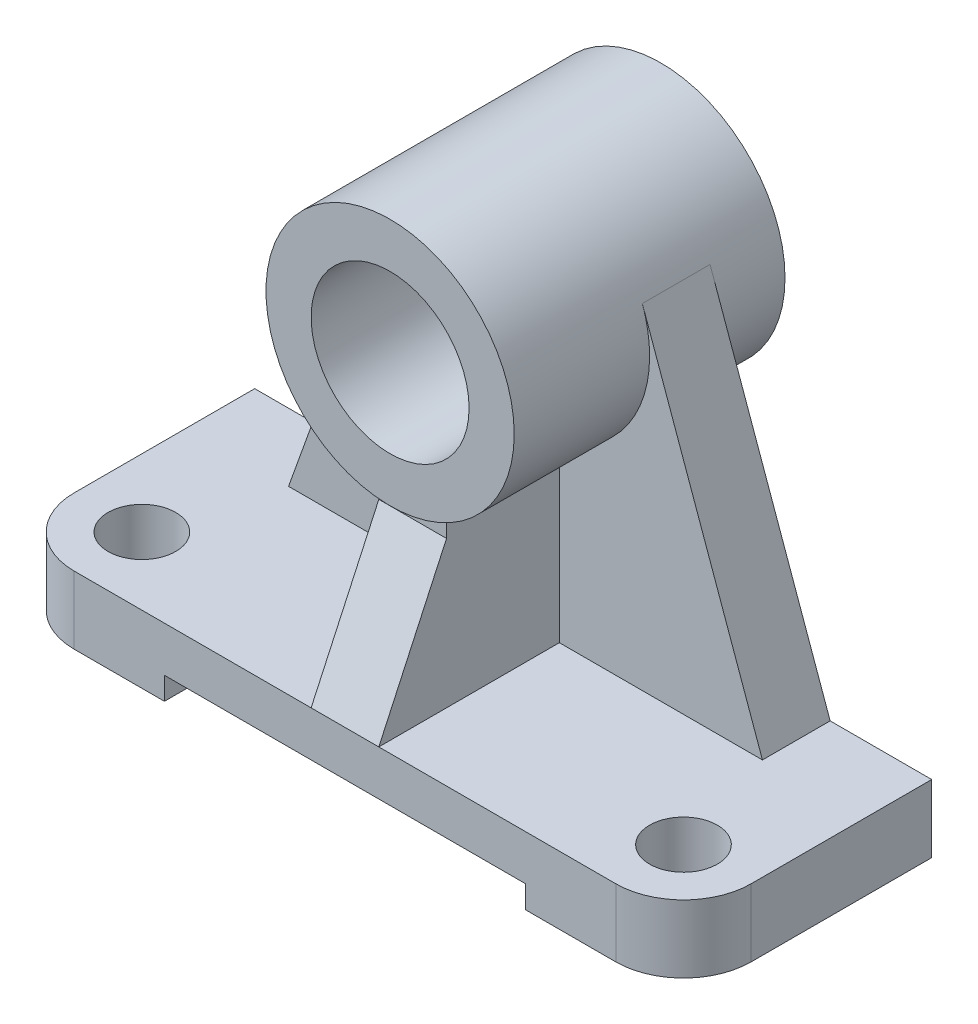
ISO-10303-21;
HEADER;
FILE_DESCRIPTION(('STEP AP214'),'2;1');
FILE_NAME('part.step','',(''),(''),'','','');
FILE_SCHEMA(('AUTOMOTIVE_DESIGN { 1 0 10303 214 1 1 1 1 }'));
ENDSEC;
DATA;
#1=APPLICATION_CONTEXT('core data for automotive mechanical design processes');
#2=APPLICATION_PROTOCOL_DEFINITION('international standard','automotive_design',2000,#1);
#3=PRODUCT_CONTEXT('',#1,'mechanical');
#4=PRODUCT('Part','Part','',(#3));
#5=PRODUCT_RELATED_PRODUCT_CATEGORY('part','',(#4));
#6=PRODUCT_DEFINITION_FORMATION('','',#4);
#7=PRODUCT_DEFINITION_CONTEXT('part definition',#1,'design');
#8=PRODUCT_DEFINITION('design','',#6,#7);
#9=PRODUCT_DEFINITION_SHAPE('','',#8);
#10=(LENGTH_UNIT() NAMED_UNIT(*) SI_UNIT(.MILLI.,.METRE.));
#11=(NAMED_UNIT(*) PLANE_ANGLE_UNIT() SI_UNIT($,.RADIAN.));
#12=(NAMED_UNIT(*) SI_UNIT($,.STERADIAN.) SOLID_ANGLE_UNIT());
#13=UNCERTAINTY_MEASURE_WITH_UNIT(LENGTH_MEASURE(1.E-05),#10,'distance_accuracy_value','');
#14=(GEOMETRIC_REPRESENTATION_CONTEXT(3) GLOBAL_UNCERTAINTY_ASSIGNED_CONTEXT((#13)) GLOBAL_UNIT_ASSIGNED_CONTEXT((#10,
#11,#12)) REPRESENTATION_CONTEXT('',''));
#15=CARTESIAN_POINT('',(0.,0.,0.));
#16=DIRECTION('',(0.,0.,1.));
#17=DIRECTION('',(1.,0.,0.));
#18=AXIS2_PLACEMENT_3D('',#15,#16,#17);
#19=CARTESIAN_POINT('',(-24.,6.,16.));
#20=DIRECTION('',(0.,1.,0.));
#21=DIRECTION('',(0.,0.,1.));
#22=AXIS2_PLACEMENT_3D('',#19,#20,#21);
#23=PLANE('',#22);
#24=CARTESIAN_POINT('',(24.,6.,16.));
#25=DIRECTION('',(0.,1.,0.));
#26=DIRECTION('',(0.,0.,-1.));
#27=AXIS2_PLACEMENT_3D('',#24,#25,#26);
#28=CIRCLE('',#27,3.);
#29=CARTESIAN_POINT('',(24.,6.,13.));
#30=VERTEX_POINT('',#29);
#31=EDGE_CURVE('E304',#30,#30,#28,.T.);
#32=ORIENTED_EDGE('',*,*,#31,.F.);
#33=EDGE_LOOP('',(#32));
#34=FACE_BOUND('',#33,.T.);
#35=DIRECTION('',(1.,0.,0.));
#36=VECTOR('',#35,1.);
#37=CARTESIAN_POINT('',(-21.,6.,6.));
#38=LINE('',#37,#36);
#39=CARTESIAN_POINT('',(3.,6.,6.));
#40=VERTEX_POINT('',#39);
#41=CARTESIAN_POINT('',(21.,6.,6.));
#42=VERTEX_POINT('',#41);
#43=EDGE_CURVE('E205',#40,#42,#38,.T.);
#44=ORIENTED_EDGE('',*,*,#43,.F.);
#45=DIRECTION('',(0.,0.,-1.));
#46=VECTOR('',#45,1.);
#47=CARTESIAN_POINT('',(3.,6.,6.));
#48=LINE('',#47,#46);
#49=CARTESIAN_POINT('',(3.,6.,22.));
#50=VERTEX_POINT('',#49);
#51=EDGE_CURVE('E180',#50,#40,#48,.T.);
#52=ORIENTED_EDGE('',*,*,#51,.F.);
#53=DIRECTION('',(1.,0.,0.));
#54=VECTOR('',#53,1.);
#55=CARTESIAN_POINT('',(-24.,6.,22.));
#56=LINE('',#55,#54);
#57=CARTESIAN_POINT('',(24.,6.,22.));
#58=VERTEX_POINT('',#57);
#59=EDGE_CURVE('E322',#50,#58,#56,.T.);
#60=ORIENTED_EDGE('',*,*,#59,.T.);
#61=CARTESIAN_POINT('',(24.,6.,16.));
#62=DIRECTION('',(0.,1.,0.));
#63=DIRECTION('',(0.,0.,-1.));
#64=AXIS2_PLACEMENT_3D('',#61,#62,#63);
#65=CIRCLE('',#64,6.);
#66=CARTESIAN_POINT('',(30.,6.,16.));
#67=VERTEX_POINT('',#66);
#68=EDGE_CURVE('E326',#58,#67,#65,.T.);
#69=ORIENTED_EDGE('',*,*,#68,.T.);
#70=DIRECTION('',(0.,0.,-1.));
#71=VECTOR('',#70,1.);
#72=CARTESIAN_POINT('',(30.,6.,0.));
#73=LINE('',#72,#71);
#74=CARTESIAN_POINT('',(30.,6.,0.));
#75=VERTEX_POINT('',#74);
#76=EDGE_CURVE('E328',#67,#75,#73,.T.);
#77=ORIENTED_EDGE('',*,*,#76,.T.);
#78=DIRECTION('',(-1.,0.,0.));
#79=VECTOR('',#78,1.);
#80=CARTESIAN_POINT('',(30.,6.,0.));
#81=LINE('',#80,#79);
#82=CARTESIAN_POINT('',(21.,6.,0.));
#83=VERTEX_POINT('',#82);
#84=EDGE_CURVE('E272',#75,#83,#81,.T.);
#85=ORIENTED_EDGE('',*,*,#84,.T.);
#86=DIRECTION('',(0.,0.,-1.));
#87=VECTOR('',#86,1.);
#88=CARTESIAN_POINT('',(21.,6.,6.));
#89=LINE('',#88,#87);
#90=EDGE_CURVE('E234',#42,#83,#89,.T.);
#91=ORIENTED_EDGE('',*,*,#90,.F.);
#92=EDGE_LOOP('',(#44,#52,#60,#69,#77,#85,#91));
#93=FACE_BOUND('',#92,.T.);
#94=ADVANCED_FACE('F31',(#34,#93),#23,.T.);
#95=CARTESIAN_POINT('',(0.,32.,6.));
#96=DIRECTION('',(0.,0.,1.));
#97=DIRECTION('',(1.,0.,0.));
#98=AXIS2_PLACEMENT_3D('',#95,#96,#97);
#99=PLANE('',#98);
#100=CARTESIAN_POINT('',(0.,32.,6.));
#101=DIRECTION('',(0.,0.,-1.));
#102=DIRECTION('',(1.,0.,0.));
#103=AXIS2_PLACEMENT_3D('',#100,#101,#102);
#104=CIRCLE('',#103,11.);
#105=CARTESIAN_POINT('',(10.3554232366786,35.7101495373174,6.));
#106=VERTEX_POINT('',#105);
#107=CARTESIAN_POINT('',(3.,21.4169947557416,6.));
#108=VERTEX_POINT('',#107);
#109=EDGE_CURVE('E209',#106,#108,#104,.T.);
#110=ORIENTED_EDGE('',*,*,#109,.T.);
#111=DIRECTION('',(0.,1.,0.));
#112=VECTOR('',#111,1.);
#113=CARTESIAN_POINT('',(3.,22.8369591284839,6.));
#114=LINE('',#113,#112);
#115=EDGE_CURVE('E188',#40,#108,#114,.T.);
#116=ORIENTED_EDGE('',*,*,#115,.F.);
#117=ORIENTED_EDGE('',*,*,#43,.T.);
#118=DIRECTION('',(-0.337286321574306,0.94140211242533,0.));
#119=VECTOR('',#118,1.);
#120=CARTESIAN_POINT('',(10.3554232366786,35.7101495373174,6.));
#121=LINE('',#120,#119);
#122=EDGE_CURVE('E204',#42,#106,#121,.T.);
#123=ORIENTED_EDGE('',*,*,#122,.T.);
#124=EDGE_LOOP('',(#110,#116,#117,#123));
#125=FACE_BOUND('',#124,.T.);
#126=ADVANCED_FACE('F267',(#125),#99,.T.);
#127=CARTESIAN_POINT('',(0.,32.,18.));
#128=DIRECTION('',(0.,0.,-1.));
#129=DIRECTION('',(-1.,0.,0.));
#130=AXIS2_PLACEMENT_3D('',#127,#128,#129);
#131=CYLINDRICAL_SURFACE('',#130,11.);
#132=CARTESIAN_POINT('',(0.,32.,18.));
#133=DIRECTION('',(0.,0.,1.));
#134=DIRECTION('',(1.,0.,0.));
#135=AXIS2_PLACEMENT_3D('',#132,#133,#134);
#136=CIRCLE('',#135,11.);
#137=CARTESIAN_POINT('',(11.,32.,18.));
#138=VERTEX_POINT('',#137);
#139=EDGE_CURVE('E195',#138,#138,#136,.T.);
#140=ORIENTED_EDGE('',*,*,#139,.F.);
#141=EDGE_LOOP('',(#140));
#142=FACE_BOUND('',#141,.T.);
#143=CARTESIAN_POINT('',(0.,32.,-6.));
#144=DIRECTION('',(0.,0.,1.));
#145=DIRECTION('',(1.,0.,0.));
#146=AXIS2_PLACEMENT_3D('',#143,#144,#145);
#147=CIRCLE('',#146,11.);
#148=CARTESIAN_POINT('',(11.,32.,-6.));
#149=VERTEX_POINT('',#148);
#150=EDGE_CURVE('E193',#149,#149,#147,.T.);
#151=ORIENTED_EDGE('',*,*,#150,.T.);
#152=EDGE_LOOP('',(#151));
#153=FACE_BOUND('',#152,.T.);
#154=DIRECTION('',(0.,0.,-1.));
#155=VECTOR('',#154,1.);
#156=CARTESIAN_POINT('',(3.,21.4169947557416,18.));
#157=LINE('',#156,#155);
#158=CARTESIAN_POINT('',(3.,21.4169947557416,16.));
#159=VERTEX_POINT('',#158);
#160=EDGE_CURVE('E11',#108,#159,#157,.F.);
#161=ORIENTED_EDGE('',*,*,#160,.F.);
#162=ORIENTED_EDGE('',*,*,#109,.F.);
#163=DIRECTION('',(0.,0.,-1.));
#164=VECTOR('',#163,1.);
#165=CARTESIAN_POINT('',(10.3554232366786,35.7101495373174,6.));
#166=LINE('',#165,#164);
#167=CARTESIAN_POINT('',(10.3554232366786,35.7101495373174,0.));
#168=VERTEX_POINT('',#167);
#169=EDGE_CURVE('E238',#106,#168,#166,.T.);
#170=ORIENTED_EDGE('',*,*,#169,.T.);
#171=CARTESIAN_POINT('',(0.,32.,0.));
#172=DIRECTION('',(0.,0.,-1.));
#173=DIRECTION('',(1.,0.,0.));
#174=AXIS2_PLACEMENT_3D('',#171,#172,#173);
#175=CIRCLE('',#174,11.);
#176=CARTESIAN_POINT('',(-10.3554232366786,35.7101495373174,0.));
#177=VERTEX_POINT('',#176);
#178=EDGE_CURVE('E215',#168,#177,#175,.T.);
#179=ORIENTED_EDGE('',*,*,#178,.T.);
#180=DIRECTION('',(0.,0.,-1.));
#181=VECTOR('',#180,1.);
#182=CARTESIAN_POINT('',(-10.3554232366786,35.7101495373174,6.));
#183=LINE('',#182,#181);
#184=CARTESIAN_POINT('',(-10.3554232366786,35.7101495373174,6.));
#185=VERTEX_POINT('',#184);
#186=EDGE_CURVE('E219',#185,#177,#183,.T.);
#187=ORIENTED_EDGE('',*,*,#186,.F.);
#188=CARTESIAN_POINT('',(-3.,21.4169947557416,6.));
#189=VERTEX_POINT('',#188);
#190=EDGE_CURVE('E208',#189,#185,#104,.T.);
#191=ORIENTED_EDGE('',*,*,#190,.F.);
#192=DIRECTION('',(0.,0.,-1.));
#193=VECTOR('',#192,1.);
#194=CARTESIAN_POINT('',(-3.,21.4169947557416,18.));
#195=LINE('',#194,#193);
#196=CARTESIAN_POINT('',(-3.,21.4169947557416,16.));
#197=VERTEX_POINT('',#196);
#198=EDGE_CURVE('E241',#189,#197,#195,.F.);
#199=ORIENTED_EDGE('',*,*,#198,.T.);
#200=CARTESIAN_POINT('',(0.,32.,16.));
#201=DIRECTION('',(0.,0.,-1.));
#202=DIRECTION('',(-1.,0.,0.));
#203=AXIS2_PLACEMENT_3D('',#200,#201,#202);
#204=CIRCLE('',#203,11.);
#205=EDGE_CURVE('E39',#159,#197,#204,.T.);
#206=ORIENTED_EDGE('',*,*,#205,.F.);
#207=EDGE_LOOP('',(#161,#162,#170,#179,#187,#191,#199,#206));
#208=FACE_BOUND('',#207,.T.);
#209=ADVANCED_FACE('F246',(#142,#153,#208),#131,.T.);
#210=CARTESIAN_POINT('',(-24.,0.,16.));
#211=DIRECTION('',(0.,1.,0.));
#212=DIRECTION('',(0.,0.,1.));
#213=AXIS2_PLACEMENT_3D('',#210,#211,#212);
#214=PLANE('',#213);
#215=CARTESIAN_POINT('',(-24.,0.,16.));
#216=DIRECTION('',(0.,1.,0.));
#217=DIRECTION('',(0.,0.,1.));
#218=AXIS2_PLACEMENT_3D('',#215,#216,#217);
#219=CIRCLE('',#218,3.);
#220=CARTESIAN_POINT('',(-24.,0.,19.));
#221=VERTEX_POINT('',#220);
#222=EDGE_CURVE('E307',#221,#221,#219,.T.);
#223=ORIENTED_EDGE('',*,*,#222,.T.);
#224=EDGE_LOOP('',(#223));
#225=FACE_BOUND('',#224,.T.);
#226=DIRECTION('',(-1.,0.,0.));
#227=VECTOR('',#226,1.);
#228=CARTESIAN_POINT('',(30.,0.,0.));
#229=LINE('',#228,#227);
#230=CARTESIAN_POINT('',(-16.,0.,0.));
#231=VERTEX_POINT('',#230);
#232=CARTESIAN_POINT('',(-30.,0.,0.));
#233=VERTEX_POINT('',#232);
#234=EDGE_CURVE('E353',#231,#233,#229,.T.);
#235=ORIENTED_EDGE('',*,*,#234,.F.);
#236=DIRECTION('',(0.,0.,1.));
#237=VECTOR('',#236,1.);
#238=CARTESIAN_POINT('',(-16.,0.,0.));
#239=LINE('',#238,#237);
#240=CARTESIAN_POINT('',(-16.,0.,22.));
#241=VERTEX_POINT('',#240);
#242=EDGE_CURVE('E288',#231,#241,#239,.T.);
#243=ORIENTED_EDGE('',*,*,#242,.T.);
#244=DIRECTION('',(1.,0.,0.));
#245=VECTOR('',#244,1.);
#246=CARTESIAN_POINT('',(-24.,0.,22.));
#247=LINE('',#246,#245);
#248=CARTESIAN_POINT('',(-24.,0.,22.));
#249=VERTEX_POINT('',#248);
#250=EDGE_CURVE('E358',#249,#241,#247,.T.);
#251=ORIENTED_EDGE('',*,*,#250,.F.);
#252=CARTESIAN_POINT('',(-24.,0.,16.));
#253=DIRECTION('',(0.,1.,0.));
#254=DIRECTION('',(0.,0.,1.));
#255=AXIS2_PLACEMENT_3D('',#252,#253,#254);
#256=CIRCLE('',#255,6.);
#257=CARTESIAN_POINT('',(-30.,0.,16.));
#258=VERTEX_POINT('',#257);
#259=EDGE_CURVE('E361',#258,#249,#256,.T.);
#260=ORIENTED_EDGE('',*,*,#259,.F.);
#261=DIRECTION('',(0.,0.,1.));
#262=VECTOR('',#261,1.);
#263=CARTESIAN_POINT('',(-30.,0.,0.));
#264=LINE('',#263,#262);
#265=EDGE_CURVE('E313',#233,#258,#264,.T.);
#266=ORIENTED_EDGE('',*,*,#265,.F.);
#267=EDGE_LOOP('',(#235,#243,#251,#260,#266));
#268=FACE_BOUND('',#267,.T.);
#269=ADVANCED_FACE('F372',(#225,#268),#214,.F.);
#270=DIRECTION('',(0.,0.,-1.));
#271=VECTOR('',#270,1.);
#272=CARTESIAN_POINT('',(-3.,6.,6.));
#273=LINE('',#272,#271);
#274=CARTESIAN_POINT('',(-3.,6.,22.));
#275=VERTEX_POINT('',#274);
#276=CARTESIAN_POINT('',(-3.,6.,6.));
#277=VERTEX_POINT('',#276);
#278=EDGE_CURVE('E255',#275,#277,#273,.T.);
#279=ORIENTED_EDGE('',*,*,#278,.T.);
#280=CARTESIAN_POINT('',(-21.,6.,6.));
#281=VERTEX_POINT('',#280);
#282=EDGE_CURVE('E201',#281,#277,#38,.T.);
#283=ORIENTED_EDGE('',*,*,#282,.F.);
#284=DIRECTION('',(0.,0.,-1.));
#285=VECTOR('',#284,1.);
#286=CARTESIAN_POINT('',(-21.,6.,6.));
#287=LINE('',#286,#285);
#288=CARTESIAN_POINT('',(-21.,6.,0.));
#289=VERTEX_POINT('',#288);
#290=EDGE_CURVE('E214',#281,#289,#287,.T.);
#291=ORIENTED_EDGE('',*,*,#290,.T.);
#292=CARTESIAN_POINT('',(-30.,6.,0.));
#293=VERTEX_POINT('',#292);
#294=EDGE_CURVE('E224',#289,#293,#81,.T.);
#295=ORIENTED_EDGE('',*,*,#294,.T.);
#296=DIRECTION('',(0.,0.,1.));
#297=VECTOR('',#296,1.);
#298=CARTESIAN_POINT('',(-30.,6.,0.));
#299=LINE('',#298,#297);
#300=CARTESIAN_POINT('',(-30.,6.,16.));
#301=VERTEX_POINT('',#300);
#302=EDGE_CURVE('E316',#293,#301,#299,.T.);
#303=ORIENTED_EDGE('',*,*,#302,.T.);
#304=CARTESIAN_POINT('',(-24.,6.,16.));
#305=DIRECTION('',(0.,1.,0.));
#306=DIRECTION('',(0.,0.,1.));
#307=AXIS2_PLACEMENT_3D('',#304,#305,#306);
#308=CIRCLE('',#307,6.);
#309=CARTESIAN_POINT('',(-24.,6.,22.));
#310=VERTEX_POINT('',#309);
#311=EDGE_CURVE('E319',#301,#310,#308,.T.);
#312=ORIENTED_EDGE('',*,*,#311,.T.);
#313=EDGE_CURVE('E323',#310,#275,#56,.T.);
#314=ORIENTED_EDGE('',*,*,#313,.T.);
#315=EDGE_LOOP('',(#279,#283,#291,#295,#303,#312,#314));
#316=FACE_BOUND('',#315,.T.);
#317=CARTESIAN_POINT('',(-24.,6.,16.));
#318=DIRECTION('',(0.,1.,0.));
#319=DIRECTION('',(0.,0.,1.));
#320=AXIS2_PLACEMENT_3D('',#317,#318,#319);
#321=CIRCLE('',#320,3.);
#322=CARTESIAN_POINT('',(-24.,6.,19.));
#323=VERTEX_POINT('',#322);
#324=EDGE_CURVE('E310',#323,#323,#321,.T.);
#325=ORIENTED_EDGE('',*,*,#324,.F.);
#326=EDGE_LOOP('',(#325));
#327=FACE_BOUND('',#326,.T.);
#328=ADVANCED_FACE('F377',(#316,#327),#23,.T.);
#329=CARTESIAN_POINT('',(16.,0.,22.));
#330=VERTEX_POINT('',#329);
#331=CARTESIAN_POINT('',(24.,0.,22.));
#332=VERTEX_POINT('',#331);
#333=EDGE_CURVE('E360',#330,#332,#247,.T.);
#334=ORIENTED_EDGE('',*,*,#333,.F.);
#335=DIRECTION('',(0.,0.,1.));
#336=VECTOR('',#335,1.);
#337=CARTESIAN_POINT('',(16.,0.,0.));
#338=LINE('',#337,#336);
#339=CARTESIAN_POINT('',(16.,0.,0.));
#340=VERTEX_POINT('',#339);
#341=EDGE_CURVE('E300',#340,#330,#338,.T.);
#342=ORIENTED_EDGE('',*,*,#341,.F.);
#343=CARTESIAN_POINT('',(30.,0.,0.));
#344=VERTEX_POINT('',#343);
#345=EDGE_CURVE('E320',#344,#340,#229,.T.);
#346=ORIENTED_EDGE('',*,*,#345,.F.);
#347=DIRECTION('',(0.,0.,-1.));
#348=VECTOR('',#347,1.);
#349=CARTESIAN_POINT('',(30.,0.,0.));
#350=LINE('',#349,#348);
#351=CARTESIAN_POINT('',(30.,0.,16.));
#352=VERTEX_POINT('',#351);
#353=EDGE_CURVE('E354',#352,#344,#350,.T.);
#354=ORIENTED_EDGE('',*,*,#353,.F.);
#355=CARTESIAN_POINT('',(24.,0.,16.));
#356=DIRECTION('',(0.,1.,0.));
#357=DIRECTION('',(0.,0.,-1.));
#358=AXIS2_PLACEMENT_3D('',#355,#356,#357);
#359=CIRCLE('',#358,6.);
#360=EDGE_CURVE('E356',#332,#352,#359,.T.);
#361=ORIENTED_EDGE('',*,*,#360,.F.);
#362=EDGE_LOOP('',(#334,#342,#346,#354,#361));
#363=FACE_BOUND('',#362,.T.);
#364=CARTESIAN_POINT('',(24.,0.,16.));
#365=DIRECTION('',(0.,1.,0.));
#366=DIRECTION('',(0.,0.,-1.));
#367=AXIS2_PLACEMENT_3D('',#364,#365,#366);
#368=CIRCLE('',#367,3.);
#369=CARTESIAN_POINT('',(24.,0.,13.));
#370=VERTEX_POINT('',#369);
#371=EDGE_CURVE('E297',#370,#370,#368,.T.);
#372=ORIENTED_EDGE('',*,*,#371,.T.);
#373=EDGE_LOOP('',(#372));
#374=FACE_BOUND('',#373,.T.);
#375=ADVANCED_FACE('F423',(#363,#374),#214,.F.);
#376=CARTESIAN_POINT('',(-30.,6.,0.));
#377=DIRECTION('',(1.,0.,0.));
#378=DIRECTION('',(0.,0.,-1.));
#379=AXIS2_PLACEMENT_3D('',#376,#377,#378);
#380=PLANE('',#379);
#381=ORIENTED_EDGE('',*,*,#265,.T.);
#382=DIRECTION('',(0.,-1.,0.));
#383=VECTOR('',#382,1.);
#384=CARTESIAN_POINT('',(-30.,6.,16.));
#385=LINE('',#384,#383);
#386=EDGE_CURVE('E243',#301,#258,#385,.T.);
#387=ORIENTED_EDGE('',*,*,#386,.F.);
#388=ORIENTED_EDGE('',*,*,#302,.F.);
#389=DIRECTION('',(0.,-1.,0.));
#390=VECTOR('',#389,1.);
#391=CARTESIAN_POINT('',(-30.,6.,0.));
#392=LINE('',#391,#390);
#393=EDGE_CURVE('E334',#293,#233,#392,.T.);
#394=ORIENTED_EDGE('',*,*,#393,.T.);
#395=EDGE_LOOP('',(#381,#387,#388,#394));
#396=FACE_BOUND('',#395,.T.);
#397=ADVANCED_FACE('F33',(#396),#380,.F.);
#398=CARTESIAN_POINT('',(-24.,6.,16.));
#399=DIRECTION('',(0.,-1.,0.));
#400=DIRECTION('',(0.,0.,-1.));
#401=AXIS2_PLACEMENT_3D('',#398,#399,#400);
#402=CYLINDRICAL_SURFACE('',#401,6.);
#403=ORIENTED_EDGE('',*,*,#259,.T.);
#404=DIRECTION('',(0.,-1.,0.));
#405=VECTOR('',#404,1.);
#406=CARTESIAN_POINT('',(-24.,6.,22.));
#407=LINE('',#406,#405);
#408=EDGE_CURVE('E337',#310,#249,#407,.T.);
#409=ORIENTED_EDGE('',*,*,#408,.F.);
#410=ORIENTED_EDGE('',*,*,#311,.F.);
#411=ORIENTED_EDGE('',*,*,#386,.T.);
#412=EDGE_LOOP('',(#403,#409,#410,#411));
#413=FACE_BOUND('',#412,.T.);
#414=ADVANCED_FACE('F374',(#413),#402,.T.);
#415=CARTESIAN_POINT('',(-24.,6.,22.));
#416=DIRECTION('',(0.,0.,-1.));
#417=DIRECTION('',(-1.,0.,0.));
#418=AXIS2_PLACEMENT_3D('',#415,#416,#417);
#419=PLANE('',#418);
#420=ORIENTED_EDGE('',*,*,#250,.T.);
#421=DIRECTION('',(0.,-1.,0.));
#422=VECTOR('',#421,1.);
#423=CARTESIAN_POINT('',(-16.,0.,22.));
#424=LINE('',#423,#422);
#425=CARTESIAN_POINT('',(-16.,2.,22.));
#426=VERTEX_POINT('',#425);
#427=EDGE_CURVE('E237',#426,#241,#424,.T.);
#428=ORIENTED_EDGE('',*,*,#427,.F.);
#429=DIRECTION('',(-1.,0.,0.));
#430=VECTOR('',#429,1.);
#431=CARTESIAN_POINT('',(-16.,2.,22.));
#432=LINE('',#431,#430);
#433=CARTESIAN_POINT('',(16.,2.,22.));
#434=VERTEX_POINT('',#433);
#435=EDGE_CURVE('E282',#434,#426,#432,.T.);
#436=ORIENTED_EDGE('',*,*,#435,.F.);
#437=DIRECTION('',(0.,1.,0.));
#438=VECTOR('',#437,1.);
#439=CARTESIAN_POINT('',(16.,0.,22.));
#440=LINE('',#439,#438);
#441=EDGE_CURVE('E290',#330,#434,#440,.T.);
#442=ORIENTED_EDGE('',*,*,#441,.F.);
#443=ORIENTED_EDGE('',*,*,#333,.T.);
#444=DIRECTION('',(0.,-1.,0.));
#445=VECTOR('',#444,1.);
#446=CARTESIAN_POINT('',(24.,6.,22.));
#447=LINE('',#446,#445);
#448=EDGE_CURVE('E340',#58,#332,#447,.T.);
#449=ORIENTED_EDGE('',*,*,#448,.F.);
#450=ORIENTED_EDGE('',*,*,#59,.F.);
#451=DIRECTION('',(-1.,0.,0.));
#452=VECTOR('',#451,1.);
#453=CARTESIAN_POINT('',(3.,6.,22.));
#454=LINE('',#453,#452);
#455=EDGE_CURVE('E178',#50,#275,#454,.T.);
#456=ORIENTED_EDGE('',*,*,#455,.T.);
#457=ORIENTED_EDGE('',*,*,#313,.F.);
#458=ORIENTED_EDGE('',*,*,#408,.T.);
#459=EDGE_LOOP('',(#420,#428,#436,#442,#443,#449,#450,#456,#457,#458));
#460=FACE_BOUND('',#459,.T.);
#461=ADVANCED_FACE('F387',(#460),#419,.F.);
#462=CARTESIAN_POINT('',(24.,6.,16.));
#463=DIRECTION('',(0.,-1.,0.));
#464=DIRECTION('',(0.,0.,-1.));
#465=AXIS2_PLACEMENT_3D('',#462,#463,#464);
#466=CYLINDRICAL_SURFACE('',#465,6.);
#467=ORIENTED_EDGE('',*,*,#360,.T.);
#468=DIRECTION('',(0.,-1.,0.));
#469=VECTOR('',#468,1.);
#470=CARTESIAN_POINT('',(30.,6.,16.));
#471=LINE('',#470,#469);
#472=EDGE_CURVE('E343',#67,#352,#471,.T.);
#473=ORIENTED_EDGE('',*,*,#472,.F.);
#474=ORIENTED_EDGE('',*,*,#68,.F.);
#475=ORIENTED_EDGE('',*,*,#448,.T.);
#476=EDGE_LOOP('',(#467,#473,#474,#475));
#477=FACE_BOUND('',#476,.T.);
#478=ADVANCED_FACE('F395',(#477),#466,.T.);
#479=CARTESIAN_POINT('',(30.,6.,0.));
#480=DIRECTION('',(-1.,0.,0.));
#481=DIRECTION('',(0.,0.,1.));
#482=AXIS2_PLACEMENT_3D('',#479,#480,#481);
#483=PLANE('',#482);
#484=ORIENTED_EDGE('',*,*,#353,.T.);
#485=DIRECTION('',(0.,-1.,0.));
#486=VECTOR('',#485,1.);
#487=CARTESIAN_POINT('',(30.,6.,0.));
#488=LINE('',#487,#486);
#489=EDGE_CURVE('E346',#75,#344,#488,.T.);
#490=ORIENTED_EDGE('',*,*,#489,.F.);
#491=ORIENTED_EDGE('',*,*,#76,.F.);
#492=ORIENTED_EDGE('',*,*,#472,.T.);
#493=EDGE_LOOP('',(#484,#490,#491,#492));
#494=FACE_BOUND('',#493,.T.);
#495=ADVANCED_FACE('F399',(#494),#483,.F.);
#496=CARTESIAN_POINT('',(30.,6.,0.));
#497=DIRECTION('',(0.,0.,1.));
#498=DIRECTION('',(1.,0.,0.));
#499=AXIS2_PLACEMENT_3D('',#496,#497,#498);
#500=PLANE('',#499);
#501=DIRECTION('',(-1.,0.,0.));
#502=VECTOR('',#501,1.);
#503=CARTESIAN_POINT('',(-16.,2.,0.));
#504=LINE('',#503,#502);
#505=CARTESIAN_POINT('',(16.,2.,0.));
#506=VERTEX_POINT('',#505);
#507=CARTESIAN_POINT('',(-16.,2.,0.));
#508=VERTEX_POINT('',#507);
#509=EDGE_CURVE('E285',#506,#508,#504,.T.);
#510=ORIENTED_EDGE('',*,*,#509,.T.);
#511=DIRECTION('',(0.,-1.,0.));
#512=VECTOR('',#511,1.);
#513=CARTESIAN_POINT('',(-16.,0.,0.));
#514=LINE('',#513,#512);
#515=EDGE_CURVE('E278',#508,#231,#514,.T.);
#516=ORIENTED_EDGE('',*,*,#515,.T.);
#517=ORIENTED_EDGE('',*,*,#234,.T.);
#518=ORIENTED_EDGE('',*,*,#393,.F.);
#519=ORIENTED_EDGE('',*,*,#294,.F.);
#520=DIRECTION('',(-0.337286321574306,-0.94140211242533,0.));
#521=VECTOR('',#520,1.);
#522=CARTESIAN_POINT('',(-10.3554232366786,35.7101495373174,0.));
#523=LINE('',#522,#521);
#524=EDGE_CURVE('E54',#177,#289,#523,.T.);
#525=ORIENTED_EDGE('',*,*,#524,.F.);
#526=ORIENTED_EDGE('',*,*,#178,.F.);
#527=DIRECTION('',(-0.337286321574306,0.94140211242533,0.));
#528=VECTOR('',#527,1.);
#529=CARTESIAN_POINT('',(10.3554232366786,35.7101495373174,0.));
#530=LINE('',#529,#528);
#531=EDGE_CURVE('E198',#83,#168,#530,.T.);
#532=ORIENTED_EDGE('',*,*,#531,.F.);
#533=ORIENTED_EDGE('',*,*,#84,.F.);
#534=ORIENTED_EDGE('',*,*,#489,.T.);
#535=ORIENTED_EDGE('',*,*,#345,.T.);
#536=DIRECTION('',(0.,1.,0.));
#537=VECTOR('',#536,1.);
#538=CARTESIAN_POINT('',(16.,0.,0.));
#539=LINE('',#538,#537);
#540=EDGE_CURVE('E281',#340,#506,#539,.T.);
#541=ORIENTED_EDGE('',*,*,#540,.T.);
#542=EDGE_LOOP('',(#510,#516,#517,#518,#519,#525,#526,#532,#533,#534,#535,#541));
#543=FACE_BOUND('',#542,.T.);
#544=ADVANCED_FACE('F381',(#543),#500,.F.);
#545=CARTESIAN_POINT('',(-24.,6.,16.));
#546=DIRECTION('',(0.,-1.,0.));
#547=DIRECTION('',(0.,0.,-1.));
#548=AXIS2_PLACEMENT_3D('',#545,#546,#547);
#549=CYLINDRICAL_SURFACE('',#548,3.);
#550=ORIENTED_EDGE('',*,*,#324,.T.);
#551=EDGE_LOOP('',(#550));
#552=FACE_BOUND('',#551,.T.);
#553=ORIENTED_EDGE('',*,*,#222,.F.);
#554=EDGE_LOOP('',(#553));
#555=FACE_BOUND('',#554,.T.);
#556=ADVANCED_FACE('F438',(#552,#555),#549,.F.);
#557=CARTESIAN_POINT('',(24.,6.,16.));
#558=DIRECTION('',(0.,-1.,0.));
#559=DIRECTION('',(0.,0.,-1.));
#560=AXIS2_PLACEMENT_3D('',#557,#558,#559);
#561=CYLINDRICAL_SURFACE('',#560,3.);
#562=ORIENTED_EDGE('',*,*,#31,.T.);
#563=EDGE_LOOP('',(#562));
#564=FACE_BOUND('',#563,.T.);
#565=ORIENTED_EDGE('',*,*,#371,.F.);
#566=EDGE_LOOP('',(#565));
#567=FACE_BOUND('',#566,.T.);
#568=ADVANCED_FACE('F468',(#564,#567),#561,.F.);
#569=CARTESIAN_POINT('',(-16.,0.,0.));
#570=DIRECTION('',(-1.,0.,0.));
#571=DIRECTION('',(0.,0.,1.));
#572=AXIS2_PLACEMENT_3D('',#569,#570,#571);
#573=PLANE('',#572);
#574=ORIENTED_EDGE('',*,*,#427,.T.);
#575=ORIENTED_EDGE('',*,*,#242,.F.);
#576=ORIENTED_EDGE('',*,*,#515,.F.);
#577=DIRECTION('',(0.,0.,1.));
#578=VECTOR('',#577,1.);
#579=CARTESIAN_POINT('',(-16.,2.,0.));
#580=LINE('',#579,#578);
#581=EDGE_CURVE('E295',#508,#426,#580,.T.);
#582=ORIENTED_EDGE('',*,*,#581,.T.);
#583=EDGE_LOOP('',(#574,#575,#576,#582));
#584=FACE_BOUND('',#583,.T.);
#585=ADVANCED_FACE('F384',(#584),#573,.F.);
#586=CARTESIAN_POINT('',(-16.,2.,0.));
#587=DIRECTION('',(0.,1.,0.));
#588=DIRECTION('',(0.,0.,1.));
#589=AXIS2_PLACEMENT_3D('',#586,#587,#588);
#590=PLANE('',#589);
#591=ORIENTED_EDGE('',*,*,#435,.T.);
#592=ORIENTED_EDGE('',*,*,#581,.F.);
#593=ORIENTED_EDGE('',*,*,#509,.F.);
#594=DIRECTION('',(0.,0.,1.));
#595=VECTOR('',#594,1.);
#596=CARTESIAN_POINT('',(16.,2.,0.));
#597=LINE('',#596,#595);
#598=EDGE_CURVE('E298',#506,#434,#597,.T.);
#599=ORIENTED_EDGE('',*,*,#598,.T.);
#600=EDGE_LOOP('',(#591,#592,#593,#599));
#601=FACE_BOUND('',#600,.T.);
#602=ADVANCED_FACE('F467',(#601),#590,.F.);
#603=CARTESIAN_POINT('',(16.,0.,0.));
#604=DIRECTION('',(1.,0.,0.));
#605=DIRECTION('',(0.,0.,-1.));
#606=AXIS2_PLACEMENT_3D('',#603,#604,#605);
#607=PLANE('',#606);
#608=ORIENTED_EDGE('',*,*,#441,.T.);
#609=ORIENTED_EDGE('',*,*,#598,.F.);
#610=ORIENTED_EDGE('',*,*,#540,.F.);
#611=ORIENTED_EDGE('',*,*,#341,.T.);
#612=EDGE_LOOP('',(#608,#609,#610,#611));
#613=FACE_BOUND('',#612,.T.);
#614=ADVANCED_FACE('F411',(#613),#607,.F.);
#615=CARTESIAN_POINT('',(10.3554232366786,35.7101495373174,6.));
#616=DIRECTION('',(-0.94140211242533,-0.337286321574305,0.));
#617=DIRECTION('',(0.337286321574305,-0.94140211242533,0.));
#618=AXIS2_PLACEMENT_3D('',#615,#616,#617);
#619=PLANE('',#618);
#620=ORIENTED_EDGE('',*,*,#531,.T.);
#621=ORIENTED_EDGE('',*,*,#169,.F.);
#622=ORIENTED_EDGE('',*,*,#122,.F.);
#623=ORIENTED_EDGE('',*,*,#90,.T.);
#624=EDGE_LOOP('',(#620,#621,#622,#623));
#625=FACE_BOUND('',#624,.T.);
#626=ADVANCED_FACE('F274',(#625),#619,.F.);
#627=CARTESIAN_POINT('',(-10.3554232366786,35.7101495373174,6.));
#628=DIRECTION('',(0.94140211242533,-0.337286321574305,0.));
#629=DIRECTION('',(0.337286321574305,0.94140211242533,0.));
#630=AXIS2_PLACEMENT_3D('',#627,#628,#629);
#631=PLANE('',#630);
#632=ORIENTED_EDGE('',*,*,#524,.T.);
#633=ORIENTED_EDGE('',*,*,#290,.F.);
#634=DIRECTION('',(-0.337286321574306,-0.94140211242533,0.));
#635=VECTOR('',#634,1.);
#636=CARTESIAN_POINT('',(-10.3554232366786,35.7101495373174,6.));
#637=LINE('',#636,#635);
#638=EDGE_CURVE('E212',#185,#281,#637,.T.);
#639=ORIENTED_EDGE('',*,*,#638,.F.);
#640=ORIENTED_EDGE('',*,*,#186,.T.);
#641=EDGE_LOOP('',(#632,#633,#639,#640));
#642=FACE_BOUND('',#641,.T.);
#643=ADVANCED_FACE('F402',(#642),#631,.F.);
#644=DIRECTION('',(0.,1.,0.));
#645=VECTOR('',#644,1.);
#646=CARTESIAN_POINT('',(-3.,22.8369591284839,6.));
#647=LINE('',#646,#645);
#648=EDGE_CURVE('E171',#277,#189,#647,.T.);
#649=ORIENTED_EDGE('',*,*,#648,.T.);
#650=ORIENTED_EDGE('',*,*,#190,.T.);
#651=ORIENTED_EDGE('',*,*,#638,.T.);
#652=ORIENTED_EDGE('',*,*,#282,.T.);
#653=EDGE_LOOP('',(#649,#650,#651,#652));
#654=FACE_BOUND('',#653,.T.);
#655=ADVANCED_FACE('F253',(#654),#99,.T.);
#656=CARTESIAN_POINT('',(0.,32.,18.));
#657=DIRECTION('',(0.,0.,1.));
#658=DIRECTION('',(1.,0.,0.));
#659=AXIS2_PLACEMENT_3D('',#656,#657,#658);
#660=PLANE('',#659);
#661=ORIENTED_EDGE('',*,*,#139,.T.);
#662=EDGE_LOOP('',(#661));
#663=FACE_BOUND('',#662,.T.);
#664=CARTESIAN_POINT('',(0.,32.,18.));
#665=DIRECTION('',(0.,0.,1.));
#666=DIRECTION('',(1.,0.,0.));
#667=AXIS2_PLACEMENT_3D('',#664,#665,#666);
#668=CIRCLE('',#667,7.);
#669=CARTESIAN_POINT('',(7.,32.,18.));
#670=VERTEX_POINT('',#669);
#671=EDGE_CURVE('E186',#670,#670,#668,.T.);
#672=ORIENTED_EDGE('',*,*,#671,.F.);
#673=EDGE_LOOP('',(#672));
#674=FACE_BOUND('',#673,.T.);
#675=ADVANCED_FACE('F409',(#663,#674),#660,.T.);
#676=CARTESIAN_POINT('',(0.,32.,-6.));
#677=DIRECTION('',(0.,0.,1.));
#678=DIRECTION('',(1.,0.,0.));
#679=AXIS2_PLACEMENT_3D('',#676,#677,#678);
#680=PLANE('',#679);
#681=ORIENTED_EDGE('',*,*,#150,.F.);
#682=EDGE_LOOP('',(#681));
#683=FACE_BOUND('',#682,.T.);
#684=CARTESIAN_POINT('',(0.,32.,-6.));
#685=DIRECTION('',(0.,0.,1.));
#686=DIRECTION('',(1.,0.,0.));
#687=AXIS2_PLACEMENT_3D('',#684,#685,#686);
#688=CIRCLE('',#687,7.);
#689=CARTESIAN_POINT('',(7.,32.,-6.));
#690=VERTEX_POINT('',#689);
#691=EDGE_CURVE('E183',#690,#690,#688,.T.);
#692=ORIENTED_EDGE('',*,*,#691,.T.);
#693=EDGE_LOOP('',(#692));
#694=FACE_BOUND('',#693,.T.);
#695=ADVANCED_FACE('F516',(#683,#694),#680,.F.);
#696=CARTESIAN_POINT('',(0.,32.,18.));
#697=DIRECTION('',(0.,0.,-1.));
#698=DIRECTION('',(-1.,0.,0.));
#699=AXIS2_PLACEMENT_3D('',#696,#697,#698);
#700=CYLINDRICAL_SURFACE('',#699,7.);
#701=ORIENTED_EDGE('',*,*,#671,.T.);
#702=EDGE_LOOP('',(#701));
#703=FACE_BOUND('',#702,.T.);
#704=ORIENTED_EDGE('',*,*,#691,.F.);
#705=EDGE_LOOP('',(#704));
#706=FACE_BOUND('',#705,.T.);
#707=ADVANCED_FACE('F526',(#703,#706),#700,.F.);
#708=CARTESIAN_POINT('',(3.,19.,16.));
#709=DIRECTION('',(0.,0.,-1.));
#710=DIRECTION('',(-1.,0.,0.));
#711=AXIS2_PLACEMENT_3D('',#708,#709,#710);
#712=PLANE('',#711);
#713=DIRECTION('',(0.,-1.,0.));
#714=VECTOR('',#713,1.);
#715=CARTESIAN_POINT('',(3.,19.,16.));
#716=LINE('',#715,#714);
#717=CARTESIAN_POINT('',(3.,19.,16.));
#718=VERTEX_POINT('',#717);
#719=EDGE_CURVE('E162',#159,#718,#716,.T.);
#720=ORIENTED_EDGE('',*,*,#719,.F.);
#721=ORIENTED_EDGE('',*,*,#205,.T.);
#722=DIRECTION('',(0.,-1.,0.));
#723=VECTOR('',#722,1.);
#724=CARTESIAN_POINT('',(-3.,19.,16.));
#725=LINE('',#724,#723);
#726=CARTESIAN_POINT('',(-3.,19.,16.));
#727=VERTEX_POINT('',#726);
#728=EDGE_CURVE('E46',#197,#727,#725,.T.);
#729=ORIENTED_EDGE('',*,*,#728,.T.);
#730=DIRECTION('',(-1.,0.,0.));
#731=VECTOR('',#730,1.);
#732=CARTESIAN_POINT('',(3.,19.,16.));
#733=LINE('',#732,#731);
#734=EDGE_CURVE('E176',#718,#727,#733,.T.);
#735=ORIENTED_EDGE('',*,*,#734,.F.);
#736=EDGE_LOOP('',(#720,#721,#729,#735));
#737=FACE_BOUND('',#736,.T.);
#738=ADVANCED_FACE('F182',(#737),#712,.F.);
#739=CARTESIAN_POINT('',(3.,22.8369591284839,16.));
#740=DIRECTION('',(-1.,0.,0.));
#741=DIRECTION('',(0.,0.,1.));
#742=AXIS2_PLACEMENT_3D('',#739,#740,#741);
#743=PLANE('',#742);
#744=ORIENTED_EDGE('',*,*,#115,.T.);
#745=ORIENTED_EDGE('',*,*,#160,.T.);
#746=ORIENTED_EDGE('',*,*,#719,.T.);
#747=DIRECTION('',(0.,-0.907959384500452,0.419058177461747));
#748=VECTOR('',#747,1.);
#749=CARTESIAN_POINT('',(3.,6.,22.));
#750=LINE('',#749,#748);
#751=EDGE_CURVE('E165',#718,#50,#750,.T.);
#752=ORIENTED_EDGE('',*,*,#751,.T.);
#753=ORIENTED_EDGE('',*,*,#51,.T.);
#754=EDGE_LOOP('',(#744,#745,#746,#752,#753));
#755=FACE_BOUND('',#754,.T.);
#756=ADVANCED_FACE('F164',(#755),#743,.F.);
#757=CARTESIAN_POINT('',(-3.,22.8369591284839,16.));
#758=DIRECTION('',(-1.,0.,0.));
#759=DIRECTION('',(0.,0.,1.));
#760=AXIS2_PLACEMENT_3D('',#757,#758,#759);
#761=PLANE('',#760);
#762=ORIENTED_EDGE('',*,*,#198,.F.);
#763=ORIENTED_EDGE('',*,*,#648,.F.);
#764=ORIENTED_EDGE('',*,*,#278,.F.);
#765=DIRECTION('',(0.,-0.907959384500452,0.419058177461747));
#766=VECTOR('',#765,1.);
#767=CARTESIAN_POINT('',(-3.,6.,22.));
#768=LINE('',#767,#766);
#769=EDGE_CURVE('E256',#727,#275,#768,.T.);
#770=ORIENTED_EDGE('',*,*,#769,.F.);
#771=ORIENTED_EDGE('',*,*,#728,.F.);
#772=EDGE_LOOP('',(#762,#763,#764,#770,#771));
#773=FACE_BOUND('',#772,.T.);
#774=ADVANCED_FACE('F249',(#773),#761,.T.);
#775=CARTESIAN_POINT('',(3.,6.,22.));
#776=DIRECTION('',(0.,-0.419058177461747,-0.907959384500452));
#777=DIRECTION('',(0.,0.907959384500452,-0.419058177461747));
#778=AXIS2_PLACEMENT_3D('',#775,#776,#777);
#779=PLANE('',#778);
#780=ORIENTED_EDGE('',*,*,#769,.T.);
#781=ORIENTED_EDGE('',*,*,#455,.F.);
#782=ORIENTED_EDGE('',*,*,#751,.F.);
#783=ORIENTED_EDGE('',*,*,#734,.T.);
#784=EDGE_LOOP('',(#780,#781,#782,#783));
#785=FACE_BOUND('',#784,.T.);
#786=ADVANCED_FACE('F175',(#785),#779,.F.);
#787=CLOSED_SHELL('',(#94,#126,#209,#269,#328,#375,#397,#414,#461,#478,#495,#544,#556,#568,#585,
#602,#614,#626,#643,#655,#675,#695,#707,#738,#756,#774,#786));
#788=MANIFOLD_SOLID_BREP('B2',#787);
#789=ADVANCED_BREP_SHAPE_REPRESENTATION('',(#18,#788),#14);
#790=SHAPE_DEFINITION_REPRESENTATION(#9,#789);
ENDSEC;
END-ISO-10303-21;
